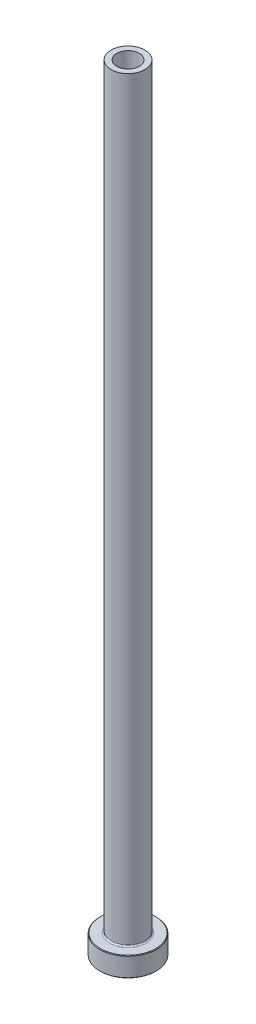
from build123d import *

# Parameters (mm, degrees)
FILLET1_R     = 0.5
CHAMFER1_SIZE = 0.2
CHAMFER3_SIZE = 0.5


with BuildPart() as part:
    # Sketch1 → Revolve1 (revolve)
    with BuildSketch(Plane.XY, mode=Mode.PRIVATE) as revolve1_sk:
        Polygon((-4, 275), (-6, 275), (-6, 7), (-10, 7), (-10, 0), (-4.25, 0), (-4.25, 218), (-4, 230), align=None)
    revolve(revolve1_sk.sketch.rotate(Axis((0, 92.187680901, 0), (0, -1, 0)), 270), axis=Axis((0, 92.187680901, 0), (0, -1, 0)))

    # Fillet1
    fillet1_edges = [part.edges().sort_by_distance(p)[0] for p in [
        (0, 7, -6),
    ]]
    fillet(fillet1_edges, radius=FILLET1_R)

    # Chamfer1
    chamfer1_edges = [part.edges().sort_by_distance(p)[0] for p in [
        (0, 0, -10),
        (0, 7, -10),
    ]]
    chamfer(chamfer1_edges, length=CHAMFER1_SIZE)

    # Chamfer3
    chamfer3_edges = [part.edges().sort_by_distance(p)[0] for p in [
        (0, 0, -4.25),
    ]]
    chamfer(chamfer3_edges, length=CHAMFER3_SIZE)


solid = part.part
